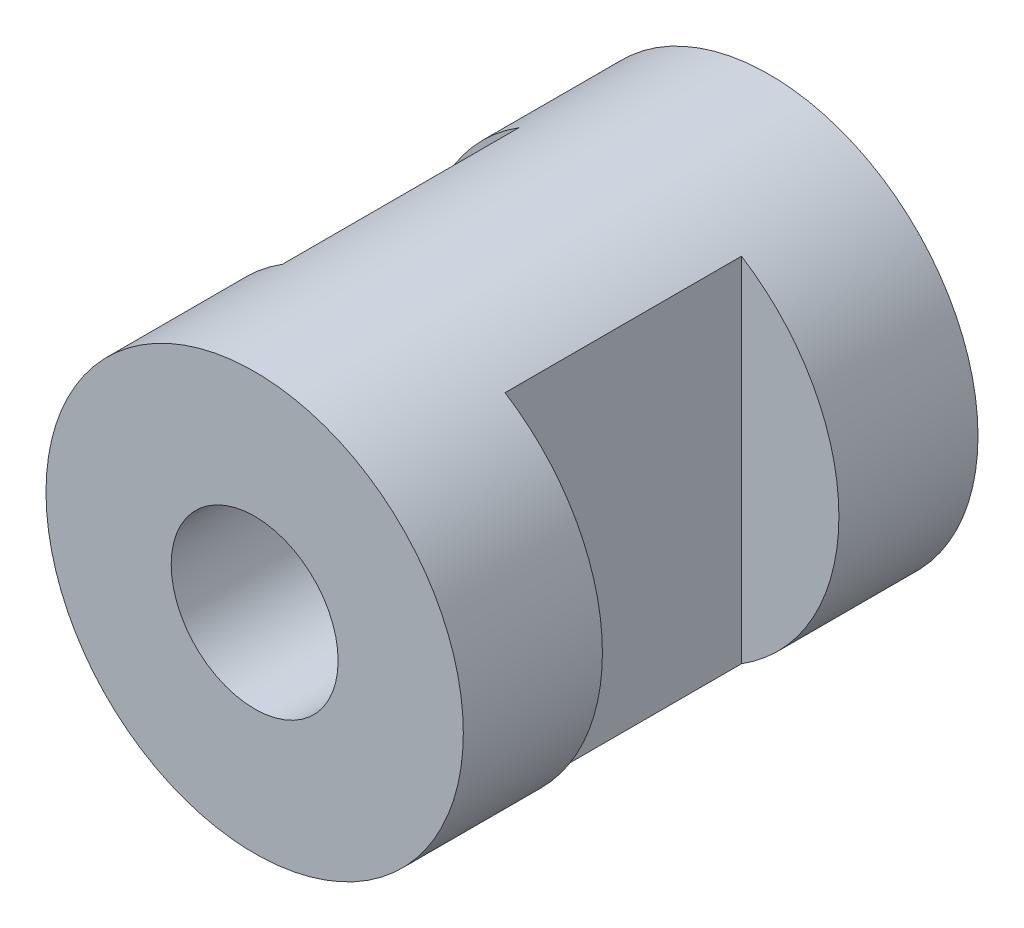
ISO-10303-21;
HEADER;
FILE_DESCRIPTION(('STEP AP214'),'2;1');
FILE_NAME('part.step','',(''),(''),'','','');
FILE_SCHEMA(('AUTOMOTIVE_DESIGN { 1 0 10303 214 1 1 1 1 }'));
ENDSEC;
DATA;
#1=APPLICATION_CONTEXT('core data for automotive mechanical design processes');
#2=APPLICATION_PROTOCOL_DEFINITION('international standard','automotive_design',2000,#1);
#3=PRODUCT_CONTEXT('',#1,'mechanical');
#4=PRODUCT('Part','Part','',(#3));
#5=PRODUCT_RELATED_PRODUCT_CATEGORY('part','',(#4));
#6=PRODUCT_DEFINITION_FORMATION('','',#4);
#7=PRODUCT_DEFINITION_CONTEXT('part definition',#1,'design');
#8=PRODUCT_DEFINITION('design','',#6,#7);
#9=PRODUCT_DEFINITION_SHAPE('','',#8);
#10=(LENGTH_UNIT() NAMED_UNIT(*) SI_UNIT(.MILLI.,.METRE.));
#11=(NAMED_UNIT(*) PLANE_ANGLE_UNIT() SI_UNIT($,.RADIAN.));
#12=(NAMED_UNIT(*) SI_UNIT($,.STERADIAN.) SOLID_ANGLE_UNIT());
#13=UNCERTAINTY_MEASURE_WITH_UNIT(LENGTH_MEASURE(1.E-05),#10,'distance_accuracy_value','');
#14=(GEOMETRIC_REPRESENTATION_CONTEXT(3) GLOBAL_UNCERTAINTY_ASSIGNED_CONTEXT((#13)) GLOBAL_UNIT_ASSIGNED_CONTEXT((#10,
#11,#12)) REPRESENTATION_CONTEXT('',''));
#15=CARTESIAN_POINT('',(0.,0.,0.));
#16=DIRECTION('',(0.,0.,1.));
#17=DIRECTION('',(1.,0.,0.));
#18=AXIS2_PLACEMENT_3D('',#15,#16,#17);
#19=CARTESIAN_POINT('',(0.,0.,18.5));
#20=DIRECTION('',(0.,0.,-1.));
#21=DIRECTION('',(-1.,0.,0.));
#22=AXIS2_PLACEMENT_3D('',#19,#20,#21);
#23=CYLINDRICAL_SURFACE('',#22,7.5);
#24=CARTESIAN_POINT('',(0.,0.,13.5));
#25=DIRECTION('',(0.,0.,1.));
#26=DIRECTION('',(1.,0.,0.));
#27=AXIS2_PLACEMENT_3D('',#24,#25,#26);
#28=CIRCLE('',#27,7.5);
#29=CARTESIAN_POINT('',(-4.,6.34428877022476,13.5));
#30=VERTEX_POINT('',#29);
#31=CARTESIAN_POINT('',(-4.,-6.34428877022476,13.5));
#32=VERTEX_POINT('',#31);
#33=EDGE_CURVE('E39',#30,#32,#28,.T.);
#34=ORIENTED_EDGE('',*,*,#33,.T.);
#35=DIRECTION('',(0.,0.,-1.));
#36=VECTOR('',#35,1.);
#37=CARTESIAN_POINT('',(-4.,-6.34428877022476,18.5));
#38=LINE('',#37,#36);
#39=CARTESIAN_POINT('',(-4.,-6.34428877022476,5.));
#40=VERTEX_POINT('',#39);
#41=EDGE_CURVE('E11',#32,#40,#38,.T.);
#42=ORIENTED_EDGE('',*,*,#41,.T.);
#43=CARTESIAN_POINT('',(0.,0.,5.));
#44=DIRECTION('',(0.,0.,-1.));
#45=DIRECTION('',(-1.,0.,0.));
#46=AXIS2_PLACEMENT_3D('',#43,#44,#45);
#47=CIRCLE('',#46,7.5);
#48=CARTESIAN_POINT('',(-4.,6.34428877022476,5.));
#49=VERTEX_POINT('',#48);
#50=EDGE_CURVE('E83',#40,#49,#47,.T.);
#51=ORIENTED_EDGE('',*,*,#50,.T.);
#52=DIRECTION('',(0.,0.,-1.));
#53=VECTOR('',#52,1.);
#54=CARTESIAN_POINT('',(-4.,6.34428877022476,18.5));
#55=LINE('',#54,#53);
#56=EDGE_CURVE('E82',#49,#30,#55,.F.);
#57=ORIENTED_EDGE('',*,*,#56,.T.);
#58=EDGE_LOOP('',(#34,#42,#51,#57));
#59=FACE_BOUND('',#58,.T.);
#60=DIRECTION('',(0.,0.,-1.));
#61=VECTOR('',#60,1.);
#62=CARTESIAN_POINT('',(4.,-6.34428877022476,18.5));
#63=LINE('',#62,#61);
#64=CARTESIAN_POINT('',(4.,-6.34428877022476,5.));
#65=VERTEX_POINT('',#64);
#66=CARTESIAN_POINT('',(4.,-6.34428877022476,13.5));
#67=VERTEX_POINT('',#66);
#68=EDGE_CURVE('E93',#65,#67,#63,.F.);
#69=ORIENTED_EDGE('',*,*,#68,.T.);
#70=CARTESIAN_POINT('',(0.,0.,13.5));
#71=DIRECTION('',(0.,0.,1.));
#72=DIRECTION('',(1.,0.,0.));
#73=AXIS2_PLACEMENT_3D('',#70,#71,#72);
#74=CIRCLE('',#73,7.5);
#75=CARTESIAN_POINT('',(4.,6.34428877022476,13.5));
#76=VERTEX_POINT('',#75);
#77=EDGE_CURVE('E87',#67,#76,#74,.T.);
#78=ORIENTED_EDGE('',*,*,#77,.T.);
#79=DIRECTION('',(0.,0.,-1.));
#80=VECTOR('',#79,1.);
#81=CARTESIAN_POINT('',(4.,6.34428877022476,18.5));
#82=LINE('',#81,#80);
#83=CARTESIAN_POINT('',(4.,6.34428877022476,5.));
#84=VERTEX_POINT('',#83);
#85=EDGE_CURVE('E90',#76,#84,#82,.T.);
#86=ORIENTED_EDGE('',*,*,#85,.T.);
#87=CARTESIAN_POINT('',(0.,0.,5.));
#88=DIRECTION('',(0.,0.,-1.));
#89=DIRECTION('',(-1.,0.,0.));
#90=AXIS2_PLACEMENT_3D('',#87,#88,#89);
#91=CIRCLE('',#90,7.5);
#92=EDGE_CURVE('E96',#84,#65,#91,.T.);
#93=ORIENTED_EDGE('',*,*,#92,.T.);
#94=EDGE_LOOP('',(#69,#78,#86,#93));
#95=FACE_BOUND('',#94,.T.);
#96=CARTESIAN_POINT('',(0.,0.,18.5));
#97=DIRECTION('',(0.,0.,1.));
#98=DIRECTION('',(1.,0.,0.));
#99=AXIS2_PLACEMENT_3D('',#96,#97,#98);
#100=CIRCLE('',#99,7.5);
#101=CARTESIAN_POINT('',(7.5,0.,18.5));
#102=VERTEX_POINT('',#101);
#103=EDGE_CURVE('E99',#102,#102,#100,.T.);
#104=ORIENTED_EDGE('',*,*,#103,.F.);
#105=EDGE_LOOP('',(#104));
#106=FACE_BOUND('',#105,.T.);
#107=CARTESIAN_POINT('',(0.,0.,0.));
#108=DIRECTION('',(0.,0.,1.));
#109=DIRECTION('',(1.,0.,0.));
#110=AXIS2_PLACEMENT_3D('',#107,#108,#109);
#111=CIRCLE('',#110,7.5);
#112=CARTESIAN_POINT('',(7.5,0.,0.));
#113=VERTEX_POINT('',#112);
#114=EDGE_CURVE('E100',#113,#113,#111,.T.);
#115=ORIENTED_EDGE('',*,*,#114,.T.);
#116=EDGE_LOOP('',(#115));
#117=FACE_BOUND('',#116,.T.);
#118=ADVANCED_FACE('F32',(#59,#95,#106,#117),#23,.T.);
#119=CARTESIAN_POINT('',(0.,0.,18.5));
#120=DIRECTION('',(0.,0.,1.));
#121=DIRECTION('',(1.,0.,0.));
#122=AXIS2_PLACEMENT_3D('',#119,#120,#121);
#123=PLANE('',#122);
#124=CARTESIAN_POINT('',(0.,0.,18.5));
#125=DIRECTION('',(0.,0.,-1.));
#126=DIRECTION('',(-1.,0.,0.));
#127=AXIS2_PLACEMENT_3D('',#124,#125,#126);
#128=CIRCLE('',#127,3.);
#129=CARTESIAN_POINT('',(-3.,0.,18.5));
#130=VERTEX_POINT('',#129);
#131=EDGE_CURVE('E79',#130,#130,#128,.T.);
#132=ORIENTED_EDGE('',*,*,#131,.T.);
#133=EDGE_LOOP('',(#132));
#134=FACE_BOUND('',#133,.T.);
#135=ORIENTED_EDGE('',*,*,#103,.T.);
#136=EDGE_LOOP('',(#135));
#137=FACE_BOUND('',#136,.T.);
#138=ADVANCED_FACE('F116',(#134,#137),#123,.T.);
#139=CARTESIAN_POINT('',(0.,0.,0.));
#140=DIRECTION('',(0.,0.,1.));
#141=DIRECTION('',(1.,0.,0.));
#142=AXIS2_PLACEMENT_3D('',#139,#140,#141);
#143=PLANE('',#142);
#144=CARTESIAN_POINT('',(0.,0.,0.));
#145=DIRECTION('',(0.,0.,-1.));
#146=DIRECTION('',(-1.,0.,0.));
#147=AXIS2_PLACEMENT_3D('',#144,#145,#146);
#148=CIRCLE('',#147,3.);
#149=CARTESIAN_POINT('',(-3.,0.,0.));
#150=VERTEX_POINT('',#149);
#151=EDGE_CURVE('E110',#150,#150,#148,.T.);
#152=ORIENTED_EDGE('',*,*,#151,.F.);
#153=EDGE_LOOP('',(#152));
#154=FACE_BOUND('',#153,.T.);
#155=ORIENTED_EDGE('',*,*,#114,.F.);
#156=EDGE_LOOP('',(#155));
#157=FACE_BOUND('',#156,.T.);
#158=ADVANCED_FACE('F125',(#154,#157),#143,.F.);
#159=CARTESIAN_POINT('',(9.12898265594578,-8.5,13.5));
#160=DIRECTION('',(0.,0.,1.));
#161=DIRECTION('',(1.,0.,0.));
#162=AXIS2_PLACEMENT_3D('',#159,#160,#161);
#163=PLANE('',#162);
#164=DIRECTION('',(0.,1.,0.));
#165=VECTOR('',#164,1.);
#166=CARTESIAN_POINT('',(4.,-8.5,13.5));
#167=LINE('',#166,#165);
#168=EDGE_CURVE('E103',#67,#76,#167,.T.);
#169=ORIENTED_EDGE('',*,*,#168,.T.);
#170=ORIENTED_EDGE('',*,*,#77,.F.);
#171=EDGE_LOOP('',(#169,#170));
#172=FACE_BOUND('',#171,.T.);
#173=ADVANCED_FACE('F128',(#172),#163,.F.);
#174=CARTESIAN_POINT('',(4.,-8.5,13.5));
#175=DIRECTION('',(-1.,0.,0.));
#176=DIRECTION('',(0.,0.,1.));
#177=AXIS2_PLACEMENT_3D('',#174,#175,#176);
#178=PLANE('',#177);
#179=ORIENTED_EDGE('',*,*,#168,.F.);
#180=ORIENTED_EDGE('',*,*,#68,.F.);
#181=DIRECTION('',(0.,1.,0.));
#182=VECTOR('',#181,1.);
#183=CARTESIAN_POINT('',(4.,-8.5,5.));
#184=LINE('',#183,#182);
#185=EDGE_CURVE('E53',#65,#84,#184,.T.);
#186=ORIENTED_EDGE('',*,*,#185,.T.);
#187=ORIENTED_EDGE('',*,*,#85,.F.);
#188=EDGE_LOOP('',(#179,#180,#186,#187));
#189=FACE_BOUND('',#188,.T.);
#190=ADVANCED_FACE('F142',(#189),#178,.F.);
#191=CARTESIAN_POINT('',(9.12898265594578,-8.5,5.));
#192=DIRECTION('',(0.,0.,-1.));
#193=DIRECTION('',(-1.,0.,0.));
#194=AXIS2_PLACEMENT_3D('',#191,#192,#193);
#195=PLANE('',#194);
#196=ORIENTED_EDGE('',*,*,#185,.F.);
#197=ORIENTED_EDGE('',*,*,#92,.F.);
#198=EDGE_LOOP('',(#196,#197));
#199=FACE_BOUND('',#198,.T.);
#200=ADVANCED_FACE('F139',(#199),#195,.F.);
#201=CARTESIAN_POINT('',(-9.12898265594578,-8.5,13.5));
#202=DIRECTION('',(0.,0.,1.));
#203=DIRECTION('',(1.,0.,0.));
#204=AXIS2_PLACEMENT_3D('',#201,#202,#203);
#205=PLANE('',#204);
#206=DIRECTION('',(0.,1.,0.));
#207=VECTOR('',#206,1.);
#208=CARTESIAN_POINT('',(-4.,-8.5,13.5));
#209=LINE('',#208,#207);
#210=EDGE_CURVE('E46',#32,#30,#209,.T.);
#211=ORIENTED_EDGE('',*,*,#210,.F.);
#212=ORIENTED_EDGE('',*,*,#33,.F.);
#213=EDGE_LOOP('',(#211,#212));
#214=FACE_BOUND('',#213,.T.);
#215=ADVANCED_FACE('F77',(#214),#205,.F.);
#216=CARTESIAN_POINT('',(-9.12898265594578,-8.5,5.));
#217=DIRECTION('',(0.,0.,-1.));
#218=DIRECTION('',(-1.,0.,0.));
#219=AXIS2_PLACEMENT_3D('',#216,#217,#218);
#220=PLANE('',#219);
#221=DIRECTION('',(0.,1.,0.));
#222=VECTOR('',#221,1.);
#223=CARTESIAN_POINT('',(-4.,-8.5,5.));
#224=LINE('',#223,#222);
#225=EDGE_CURVE('E72',#40,#49,#224,.T.);
#226=ORIENTED_EDGE('',*,*,#225,.T.);
#227=ORIENTED_EDGE('',*,*,#50,.F.);
#228=EDGE_LOOP('',(#226,#227));
#229=FACE_BOUND('',#228,.T.);
#230=ADVANCED_FACE('F151',(#229),#220,.F.);
#231=CARTESIAN_POINT('',(-4.,-8.5,13.5));
#232=DIRECTION('',(1.,0.,0.));
#233=DIRECTION('',(0.,0.,-1.));
#234=AXIS2_PLACEMENT_3D('',#231,#232,#233);
#235=PLANE('',#234);
#236=ORIENTED_EDGE('',*,*,#210,.T.);
#237=ORIENTED_EDGE('',*,*,#56,.F.);
#238=ORIENTED_EDGE('',*,*,#225,.F.);
#239=ORIENTED_EDGE('',*,*,#41,.F.);
#240=EDGE_LOOP('',(#236,#237,#238,#239));
#241=FACE_BOUND('',#240,.T.);
#242=ADVANCED_FACE('F70',(#241),#235,.F.);
#243=CARTESIAN_POINT('',(0.,0.,18.5));
#244=DIRECTION('',(0.,0.,-1.));
#245=DIRECTION('',(-1.,0.,0.));
#246=AXIS2_PLACEMENT_3D('',#243,#244,#245);
#247=CYLINDRICAL_SURFACE('',#246,3.);
#248=ORIENTED_EDGE('',*,*,#131,.F.);
#249=EDGE_LOOP('',(#248));
#250=FACE_BOUND('',#249,.T.);
#251=ORIENTED_EDGE('',*,*,#151,.T.);
#252=EDGE_LOOP('',(#251));
#253=FACE_BOUND('',#252,.T.);
#254=ADVANCED_FACE('F119',(#250,#253),#247,.F.);
#255=CLOSED_SHELL('',(#118,#138,#158,#173,#190,#200,#215,#230,#242,#254));
#256=MANIFOLD_SOLID_BREP('B2',#255);
#257=ADVANCED_BREP_SHAPE_REPRESENTATION('',(#18,#256),#14);
#258=SHAPE_DEFINITION_REPRESENTATION(#9,#257);
ENDSEC;
END-ISO-10303-21;
